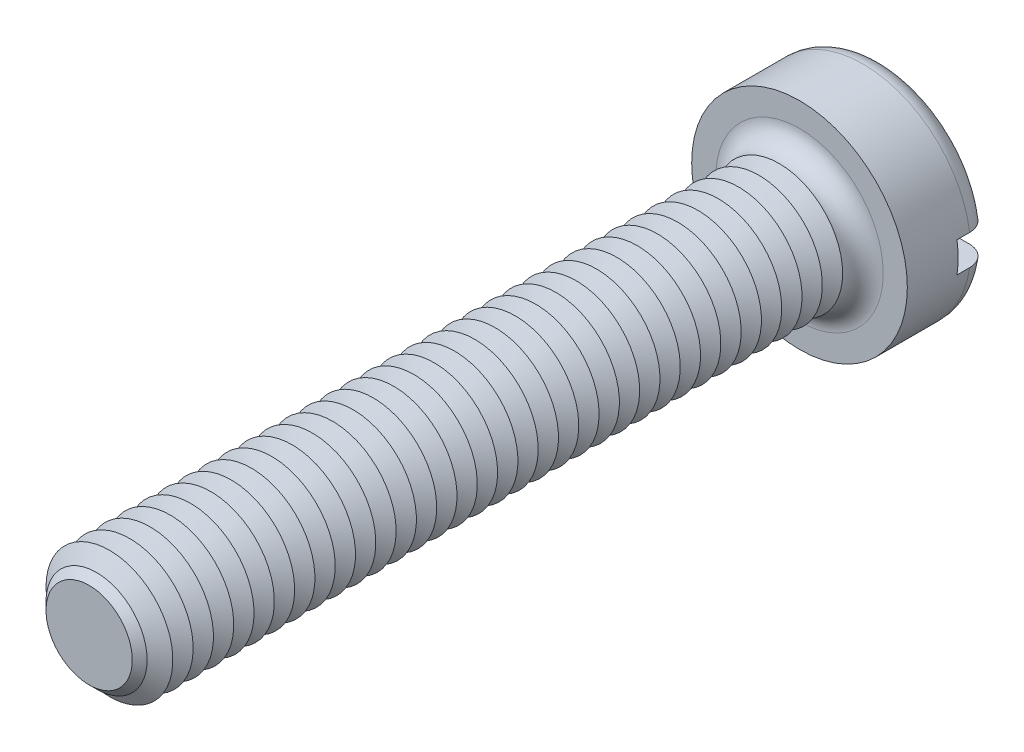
from build123d import *

# Parameters (mm, degrees)
SKETCH3_R           = 4.25
BOSS_EXTRUDE2_DEPTH = 3.3
SKETCH4_R           = 2.5
BOSS_EXTRUDE3_DEPTH = 28
FILLET1_R           = 0.8
CHAMFER1_SIZE       = 0.8
LPATTERN1_COUNT     = 34
LPATTERN1_PITCH     = 0.8
SKETCH8_W           = 8.5
SKETCH8_H           = 1.2
CUT_EXTRUDE1_DEPTH  = 1.3


with BuildPart() as part:
    # Sketch3 → Boss-Extrude2 (new body)
    with BuildSketch(Plane.XY):
        Circle(SKETCH3_R)
    extrude(amount=-BOSS_EXTRUDE2_DEPTH)

    # Sketch4 → Boss-Extrude3 (add)
    with BuildSketch(Plane.XY):
        Circle(SKETCH4_R)
    extrude(amount=BOSS_EXTRUDE3_DEPTH)

    # Fillet1
    fillet1_edges = [part.edges().sort_by_distance(p)[0] for p in [
        (-4.25, 0, -3.3),
        (-2.5, 0, 0),
    ]]
    fillet(fillet1_edges, radius=FILLET1_R)

    # Chamfer1
    chamfer1_edges = [part.edges().sort_by_distance(p)[0] for p in [
        (-2.5, 0, 28),
    ]]
    chamfer(chamfer1_edges, length=CHAMFER1_SIZE)

    # Sketch6 → Cut-Revolve1 (revolve, cut)
    with BuildSketch(Plane(origin=(0, 0, 0), x_dir=(0, 0, -1), z_dir=(1, 0, 0)), mode=Mode.PRIVATE) as cut_revolve1_sk:
        Polygon((-0.8, 2.5), (-1.2, 1.807179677), (-1.6, 2.5), align=None)
    cut_revolve1 = revolve(cut_revolve1_sk.sketch.rotate(Axis((0, 0, -1.694361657), (0, 0, 1)), 90), axis=Axis((0, 0, -1.694361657), (0, 0, 1)), mode=Mode.SUBTRACT)

    # LPattern1: Cut-Revolve1 ×34
    with Locations(*[(0, 0, i * LPATTERN1_PITCH) for i in range(1, LPATTERN1_COUNT)]):
        add(cut_revolve1, mode=Mode.SUBTRACT)

    # Sketch8 → Cut-Extrude1 (cut)
    with BuildSketch(Plane(origin=(0, 0, -3.3), x_dir=(-1, 0, 0), z_dir=(0, 0, -1))):
        Rectangle(SKETCH8_W, SKETCH8_H)
    extrude(amount=-CUT_EXTRUDE1_DEPTH, mode=Mode.SUBTRACT)


solid = part.part
